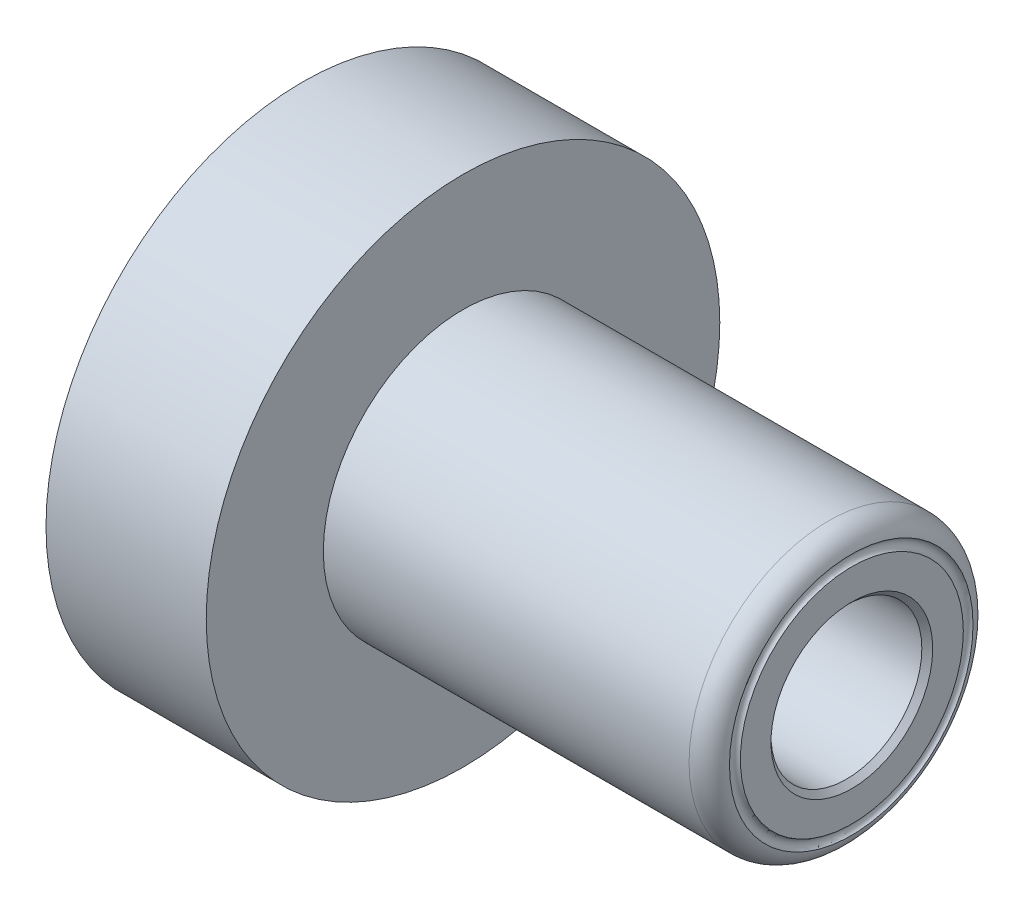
from build123d import *

# Parameters (mm, degrees)
SKETCH2_R          = 1.6129
CUT_EXTRUDE1_DEPTH = 6.35
SKETCH3_R          = 5.13
CUT_EXTRUDE2_DEPTH = 45.766103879
CHAMFER1_SIZE      = 0.37
SKETCH4_R          = 0.381


with BuildPart() as part:
    # Sketch1 → Revolve1 (revolve)
    with BuildSketch(Plane.XY, mode=Mode.PRIVATE) as revolve1_sk:
        with BuildLine():
            Line((0, 6.7437), (0, 17.4625))
            Line((0, 17.4625), (10.8966, 17.4625))
            Line((10.8966, 17.4625), (10.8966, 9.4996))
            Line((10.8966, 9.4996), (35.768, 9.4996))
            ThreePointArc((35.768, 9.4996), (36.878157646, 9.039757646), (37.338, 7.9296))
            Line((37.338, 7.9296), (37.338, 0))
            Line((37.338, 0), (20.447, 0))
            Line((20.447, 0), (20.447, 6.7437))
            Line((20.447, 6.7437), (0, 6.7437))
        make_face()
    revolve(revolve1_sk.sketch.rotate(Axis((0, 0, 0), (1, 0, 0)), 90), axis=Axis((0, 0, 0), (1, 0, 0)))

    # Sketch2 → Cut-Extrude1 (cut)
    with BuildSketch(Plane.ZY):
        with Locations((-11.1125, 0)):
            Circle(SKETCH2_R)
        with Locations(Location((11.1125, 0, 0), (0, 0, 180))):
            Circle(SKETCH2_R)
    extrude(amount=-CUT_EXTRUDE1_DEPTH, mode=Mode.SUBTRACT)

    # Sketch3 → Cut-Extrude2 (cut, through all)
    with BuildSketch(Plane(origin=(37.338, 0, 0), x_dir=(0, 0, -1), z_dir=(1, 0, 0))):
        Circle(SKETCH3_R)
    extrude(amount=-CUT_EXTRUDE2_DEPTH, mode=Mode.SUBTRACT)

    # Chamfer1
    chamfer1_edges = [part.edges().sort_by_distance(p)[0] for p in [
        (37.338, 0, 5.13),
    ]]
    chamfer(chamfer1_edges, length=CHAMFER1_SIZE)

    # Sketch4 → Cut-Revolve1 (revolve, cut)
    with BuildSketch(Plane.XY, mode=Mode.PRIVATE) as cut_revolve1_sk:
        with Locations((37.467, 7.94)):
            Circle(SKETCH4_R)
    revolve(cut_revolve1_sk.sketch.rotate(Axis((0, 0, 0), (1, 0, 0)), 90), axis=Axis((0, 0, 0), (1, 0, 0)), mode=Mode.SUBTRACT)


solid = part.part
